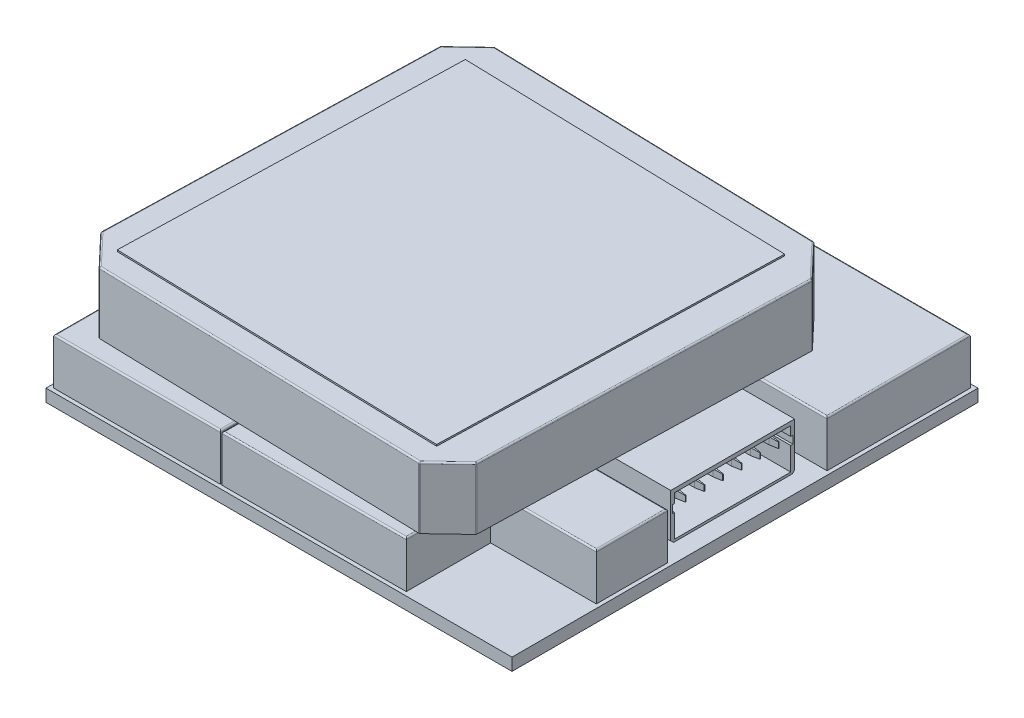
from build123d import *
from OCP.BRepFilletAPI import BRepFilletAPI_MakeChamfer

# Parameters (mm, degrees)
SKETCH1_W           = 30.1
SKETCH1_H           = 30.1
BOSS_EXTRUDE1_DEPTH = 0.8
SKETCH2_W           = 10.771359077
SKETCH2_H           = 17.6
BOSS_EXTRUDE2_DEPTH = 3
FILLET1_R           = 0.1
SKETCH3_W           = 0.393223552
SKETCH3_H           = 8
BOSS_EXTRUDE3_DEPTH = 3
BOSS_EXTRUDE4_DEPTH = 5
SKETCH5_W           = 0.139227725
SKETCH5_H           = 0.457931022
BOSS_EXTRUDE5_DEPTH = 5
CHAMFER1_SIZE       = 0.05
CHAMFER1_SIZE2      = 0.571502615
BOSS_EXTRUDE6_DEPTH = 4
BOSS_EXTRUDE7_DEPTH = 0.1
FILLET2_R           = 0.1


with BuildPart() as part:
    # Sketch1 → Boss-Extrude1 (new body)
    with BuildSketch(Plane(origin=(0, 0, 0), x_dir=(1, 0, 0), z_dir=(0, 1, 0))):
        with Locations((15.05, 15.05)):
            Rectangle(SKETCH1_W, SKETCH1_H)
    extrude(amount=BOSS_EXTRUDE1_DEPTH)

    # Sketch2 → Boss-Extrude2 (add)
    with BuildSketch(Plane(origin=(0, 0.8, 0), x_dir=(1, 0, 0), z_dir=(0, 1, 0))):
        Polygon((29.85, 29.85), (0.25, 29.85), (0.25, 17.95), (11.121359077, 17.95), (11.121359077, 0.25), (23.021359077, 0.25), (23.021359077, 5.7), (29.85, 5.7), (29.85, 10.3), (23.021359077, 10.3), (23.021359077, 20.6), (29.85, 20.6), align=None)
        with Locations((5.635679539, 9.05)):
            Rectangle(SKETCH2_W, SKETCH2_H)
    extrude(amount=BOSS_EXTRUDE2_DEPTH)

    # Fillet1
    fillet1_edges = [part.edges().sort_by_distance(p)[0] for p in [
        (29.85, 3.8, -25.225),
        (15.05, 3.8, -29.85),
        (0.25, 3.8, -23.9),
        (5.685679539, 3.8, -17.95),
        (11.121359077, 3.8, -9.1),
        (17.071359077, 3.8, -0.25),
        (23.021359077, 3.8, -2.975),
        (26.435679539, 3.8, -5.7),
        (29.85, 3.8, -8),
        (26.435679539, 3.8, -10.3),
        (23.021359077, 3.8, -15.45),
        (26.435679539, 3.8, -20.6),
        (11.021359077, 3.8, -9.05),
        (5.635679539, 3.8, -17.85),
        (0.25, 3.8, -9.05),
        (5.635679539, 3.8, -0.25),
    ]]
    fillet(fillet1_edges, radius=FILLET1_R)

    # Sketch3 → Boss-Extrude3 (add)
    with BuildSketch(Plane(origin=(0, 0.8, 0), x_dir=(1, 0, 0), z_dir=(0, 1, 0))):
        with Locations((23.705954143, 15.45)):
            Rectangle(SKETCH3_W, SKETCH3_H)
    extrude(amount=BOSS_EXTRUDE3_DEPTH)

    # Sketch4 → Boss-Extrude4 (add)
    with BuildSketch(Plane(origin=(23.902565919, 0, 0), x_dir=(0, 0, -1), z_dir=(1, 0, 0))):
        Polygon((11.45, 3.8), (19.45, 3.8), (19.45, 0.954176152), (19.310192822, 0.8), (11.645064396, 0.8), (11.45, 0.976884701), align=None)
        Polygon((11.7, 3.55), (19.2, 3.55), (19.2, 2.943906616), (19.339550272, 2.943906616), (19.339550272, 2.443906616), (19.2, 2.443906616), (19.2, 0.954176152), (11.7, 0.954176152), (11.7, 2.443906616), (11.560449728, 2.443906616), (11.560449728, 2.943906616), (11.7, 2.943906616), align=None, mode=Mode.SUBTRACT)
    extrude(amount=BOSS_EXTRUDE4_DEPTH)

    # Sketch5 → Boss-Extrude5 (add)
    with BuildSketch(Plane(origin=(23.902565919, 0, 0), x_dir=(0, 0, -1), z_dir=(1, 0, 0))):
        with Locations((13.629724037, 2.842775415)):
            Rectangle(SKETCH5_W, SKETCH5_H)
        with Locations((12.429724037, 2.842775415)):
            Rectangle(SKETCH5_W, SKETCH5_H)
        with Locations((14.829724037, 2.842775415)):
            Rectangle(SKETCH5_W, SKETCH5_H)
        with Locations((16.029724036, 2.842775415)):
            Rectangle(SKETCH5_W, SKETCH5_H)
        with Locations((17.229724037, 2.842775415)):
            Rectangle(SKETCH5_W, SKETCH5_H)
        with Locations((18.429724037, 2.842775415)):
            Rectangle(SKETCH5_W, SKETCH5_H)
    extrude(amount=BOSS_EXTRUDE5_DEPTH)

    # Chamfer1: one chamfer whose edges measure the first distance from different faces: ONE call of the kernel's chamfer builder (chamfer() names one face for all edges)
    chamfer1_edges_1 = [part.edges().sort_by_distance(p)[0] for p in [
        (28.902565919, 2.842775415, -12.360110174),
        (28.902565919, 2.613809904, -12.429724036),
        (28.902565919, 2.842775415, -12.499337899),
        (28.902565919, 3.071740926, -12.429724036),
    ]]
    chamfer1_side_1 = [part.faces().sort_by_distance(p)[0] for p in [
        (28.902565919, 2.842775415, -12.429724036),
    ]]
    chamfer1_edges_2 = [part.edges().sort_by_distance(p)[0] for p in [
        (28.902565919, 2.842775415, -13.560110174),
        (28.902565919, 2.613809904, -13.629724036),
        (28.902565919, 2.842775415, -13.699337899),
        (28.902565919, 3.071740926, -13.629724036),
    ]]
    chamfer1_side_2 = [part.faces().sort_by_distance(p)[0] for p in [
        (28.902565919, 2.842775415, -13.629724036),
    ]]
    chamfer1_edges_3 = [part.edges().sort_by_distance(p)[0] for p in [
        (28.902565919, 2.842775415, -14.760110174),
        (28.902565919, 2.613809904, -14.829724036),
        (28.902565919, 2.842775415, -14.899337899),
        (28.902565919, 3.071740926, -14.829724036),
    ]]
    chamfer1_side_3 = [part.faces().sort_by_distance(p)[0] for p in [
        (28.902565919, 2.842775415, -14.829724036),
    ]]
    chamfer1_edges_4 = [part.edges().sort_by_distance(p)[0] for p in [
        (28.902565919, 2.842775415, -15.960110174),
        (28.902565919, 2.613809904, -16.029724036),
        (28.902565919, 2.842775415, -16.099337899),
        (28.902565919, 3.071740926, -16.029724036),
    ]]
    chamfer1_side_4 = [part.faces().sort_by_distance(p)[0] for p in [
        (28.902565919, 2.842775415, -16.029724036),
    ]]
    chamfer1_edges_5 = [part.edges().sort_by_distance(p)[0] for p in [
        (28.902565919, 2.842775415, -17.160110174),
        (28.902565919, 2.613809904, -17.229724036),
        (28.902565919, 2.842775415, -17.299337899),
        (28.902565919, 3.071740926, -17.229724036),
    ]]
    chamfer1_side_5 = [part.faces().sort_by_distance(p)[0] for p in [
        (28.902565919, 2.842775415, -17.229724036),
    ]]
    chamfer1_edges_6 = [part.edges().sort_by_distance(p)[0] for p in [
        (28.902565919, 2.842775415, -18.360110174),
        (28.902565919, 2.613809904, -18.429724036),
        (28.902565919, 2.842775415, -18.499337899),
        (28.902565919, 3.071740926, -18.429724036),
    ]]
    chamfer1_side_6 = [part.faces().sort_by_distance(p)[0] for p in [
        (28.902565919, 2.842775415, -18.429724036),
    ]]
    chamfer1 = BRepFilletAPI_MakeChamfer(part.part.solid().wrapped)
    for e in chamfer1_edges_1:
        chamfer1.Add(CHAMFER1_SIZE, CHAMFER1_SIZE2, e.wrapped, chamfer1_side_1[0].wrapped)  # the first distance lies on this face
    for e in chamfer1_edges_2:
        chamfer1.Add(CHAMFER1_SIZE, CHAMFER1_SIZE2, e.wrapped, chamfer1_side_2[0].wrapped)  # the first distance lies on this face
    for e in chamfer1_edges_3:
        chamfer1.Add(CHAMFER1_SIZE, CHAMFER1_SIZE2, e.wrapped, chamfer1_side_3[0].wrapped)  # the first distance lies on this face
    for e in chamfer1_edges_4:
        chamfer1.Add(CHAMFER1_SIZE, CHAMFER1_SIZE2, e.wrapped, chamfer1_side_4[0].wrapped)  # the first distance lies on this face
    for e in chamfer1_edges_5:
        chamfer1.Add(CHAMFER1_SIZE, CHAMFER1_SIZE2, e.wrapped, chamfer1_side_5[0].wrapped)  # the first distance lies on this face
    for e in chamfer1_edges_6:
        chamfer1.Add(CHAMFER1_SIZE, CHAMFER1_SIZE2, e.wrapped, chamfer1_side_6[0].wrapped)  # the first distance lies on this face
    add(Compound.cast(chamfer1.Shape()), mode=Mode.REPLACE)

    # Sketch6 → Boss-Extrude6 (add)
    with BuildSketch(Plane(origin=(0, 3.8, 0), x_dir=(1, 0, 0), z_dir=(0, 1, 0))):
        Polygon((2.384156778, 26.595544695), (23.597073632, 26.020012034), (25.660080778, 23.841939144), (25.08668319, 2.707716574), (23.200865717, 0.921525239), (1.93262783, 1.498558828), (0, 3.5389804), (0.579168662, 24.885912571), align=None)
    extrude(amount=BOSS_EXTRUDE6_DEPTH)

    # Sketch7 → Boss-Extrude7 (add)
    with BuildSketch(Plane(origin=(0, 7.8, 0), x_dir=(1, 0, 0), z_dir=(0, 1, 0))):
        Polygon((2.259866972, 24.824959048), (23.462598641, 24.249702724), (22.868758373, 2.362006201), (1.666026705, 2.937262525), align=None)
    extrude(amount=BOSS_EXTRUDE7_DEPTH)

    # Fillet2
    fillet2_edges = [part.edges().sort_by_distance(p)[0] for p in [
        (2.384156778, 5.8, -26.595544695),
        (0.579168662, 5.8, -24.885912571),
        (0, 5.8, -3.5389804),
        (1.93262783, 5.8, -1.498558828),
        (23.200865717, 5.8, -0.921525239),
        (25.08668319, 5.8, -2.707716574),
        (25.660080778, 5.8, -23.841939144),
        (23.597073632, 5.8, -26.020012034),
        (1.48166272, 7.8, -25.740728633),
        (0.289584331, 7.8, -14.212446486),
        (0.966313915, 7.8, -2.518769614),
        (12.566746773, 7.8, -1.210042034),
        (24.143774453, 7.8, -1.814620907),
        (25.373381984, 7.8, -13.274827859),
        (24.628577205, 7.8, -24.930975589),
        (12.990615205, 7.8, -26.307778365),
    ]]
    fillet(fillet2_edges, radius=FILLET2_R)


solid = part.part
